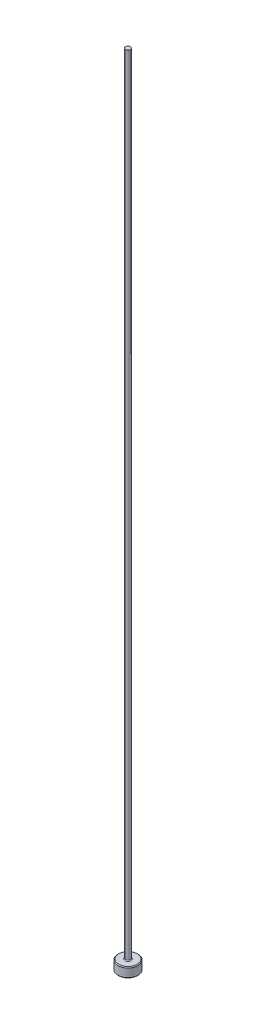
from build123d import *

# Parameters (mm, degrees)
CHAMFER1_SIZE = 0.254
FILLET1_R     = 0.254


with BuildPart() as part:
    # Sketch1 → Revolve1 (revolve)
    with BuildSketch(Plane.XY, mode=Mode.PRIVATE) as revolve1_sk:
        Polygon((0, 0), (-3.175, 0), (-3.175, 3.175), (-0.79375, 3.175), (-0.79375, 254), (0, 254), align=None)
    revolve(revolve1_sk.sketch.rotate(Axis((0, 259.958771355, 0), (0, -1, 0)), 270), axis=Axis((0, 259.958771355, 0), (0, -1, 0)))

    # Chamfer1
    chamfer1_edges = [part.edges().sort_by_distance(p)[0] for p in [
        (0, 3.175, -3.175),
        (0, 0, -3.175),
    ]]
    chamfer(chamfer1_edges, length=CHAMFER1_SIZE)

    # Fillet1
    fillet1_edges = [part.edges().sort_by_distance(p)[0] for p in [
        (0, 3.175, -0.79375),
    ]]
    fillet(fillet1_edges, radius=FILLET1_R)


solid = part.part
